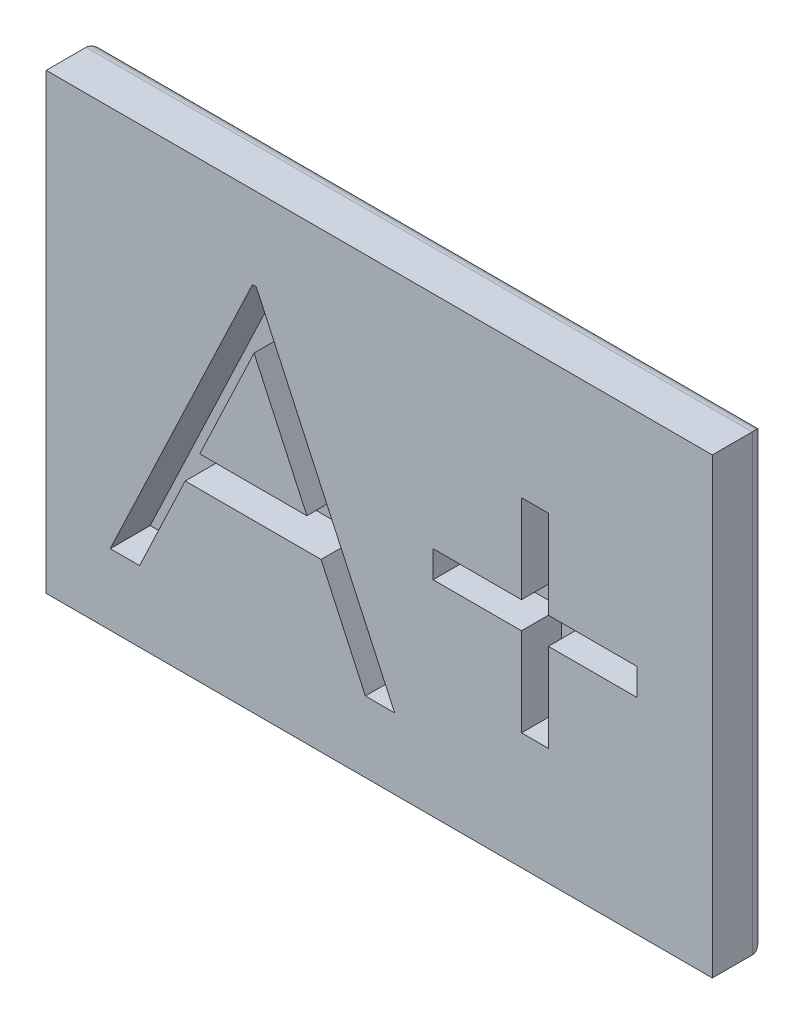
from build123d import *

# Parameters (mm, degrees)
SKETCH1_W           = 31.75
SKETCH1_H           = 21.59
BOSS_EXTRUDE1_DEPTH = 2.54
FILLET1_R           = 0.635
CUT_EXTRUDE1_DEPTH  = 1.905


with BuildPart() as part:
    # Sketch1 → Boss-Extrude1 (new body)
    with BuildSketch(Plane.XY):
        Rectangle(SKETCH1_W, SKETCH1_H)
    extrude(amount=BOSS_EXTRUDE1_DEPTH)

    # Fillet1
    fillet1_edges = [part.edges().sort_by_distance(p)[0] for p in [
        (0, -10.795, 0),
        (-15.875, 0, 0),
        (0, 10.795, 0),
        (15.875, 0, 0),
    ]]
    fillet(fillet1_edges, radius=FILLET1_R)

    # Sketch2 → Cut-Extrude1 (cut)
    # profile 1 of 2: a face of its own
    with BuildSketch(Plane.XY.offset(2.54)):
        Polygon((-5.861538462, 6.864769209), (0.732692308, -7.422730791), (-0.661140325, -7.422730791), (-2.773354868, -2.843403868), (-9.250240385, -2.843403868), (-11.422558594, -7.422730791), (-12.822115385, -7.422730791), (-6.044711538, 6.864769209), align=None)
        Polygon((-5.967435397, 4.079966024), (-8.554755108, -1.378019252), (-3.448805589, -1.378019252), align=None, mode=Mode.SUBTRACT)
    # profile 2 of 2: a face of its own
    with BuildSketch(Plane.XY.offset(2.54)):
        Polygon((6.777403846, 0.27053844), (6.777403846, 4.483519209), (8.059615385, 4.483519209), (8.059615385, 0.27053844), (12.272596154, 0.27053844), (12.272596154, -1.011673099), (8.059615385, -1.011673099), (8.059615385, -5.224653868), (6.777403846, -5.224653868), (6.777403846, -1.011673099), (2.564423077, -1.011673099), (2.564423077, 0.27053844), align=None)
    extrude(amount=-CUT_EXTRUDE1_DEPTH, mode=Mode.SUBTRACT)


solid = part.part
